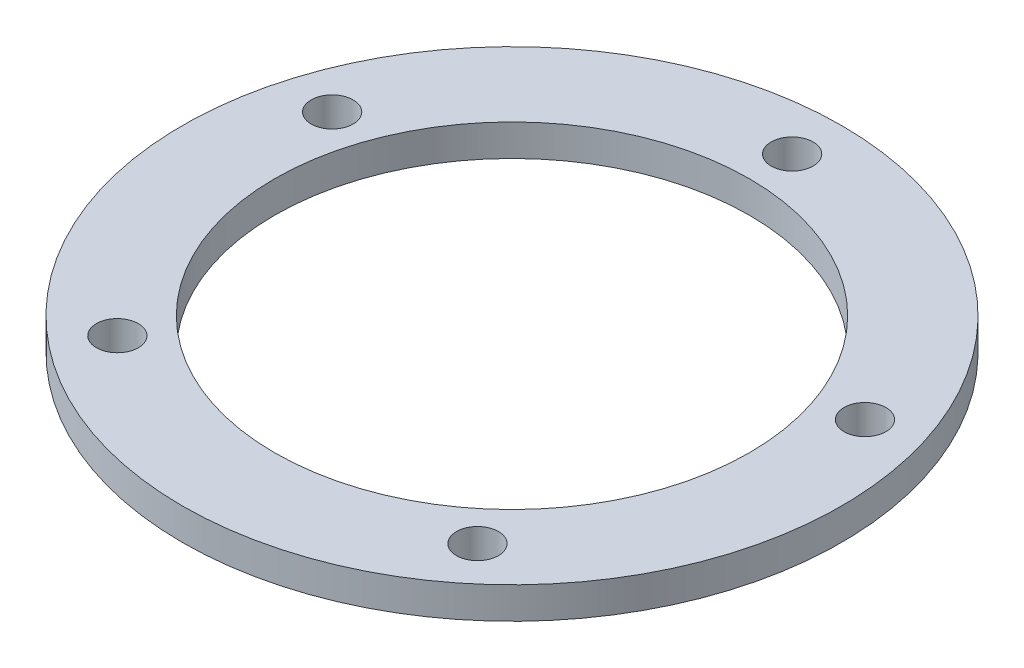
from build123d import *

# Parameters (mm, degrees)
SKETCH13_R       = 31.75
SKETCH13_R_2     = 22.868581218
RING_DEPTH       = 3.048
HOLES_DEPTH      = 46.004614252
HOLES_DEPTH_BACK = 46.004614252
SKETCH15_R       = 2.0193


with BuildPart() as part:
    # Sketch13 → Ring (new body)
    with BuildSketch(Plane(origin=(0, 0, 0), x_dir=(1, 0, 0), z_dir=(0, 1, 0))):
        with Locations(Location((0, 0, 0), (0, 0, 90))):
            Circle(SKETCH13_R)
        with Locations(Location((0, 0, 0), (0, 0, 90))):
            Circle(SKETCH13_R_2, mode=Mode.SUBTRACT)
    extrude(amount=RING_DEPTH)

    # Sketch15 → Holes (cut, two sides: drawn at the far end of the back side and taken through both)
    with BuildSketch(Plane(origin=(0, 3.048, 0), x_dir=(1, 0, 0), z_dir=(0, 1, 0)).offset(-HOLES_DEPTH_BACK)):
        with Locations(Location((0, 26.9875, 0), (0, 0, 270))):
            Circle(SKETCH15_R)
        with Locations(Location((25.666637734, 8.339596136, 0), (0, 0, 270))):
            Circle(SKETCH15_R)
        with Locations(Location((17.347230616, -20.673624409, 0), (0, 0, 270))):
            Circle(SKETCH15_R)
        with Locations(Location((-17.347230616, -20.673624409, 0), (0, 0, 270))):
            Circle(SKETCH15_R)
        with Locations(Location((-25.666637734, 8.339596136, 0), (0, 0, 270))):
            Circle(SKETCH15_R)
    extrude(amount=HOLES_DEPTH + HOLES_DEPTH_BACK, mode=Mode.SUBTRACT)


solid = part.part
